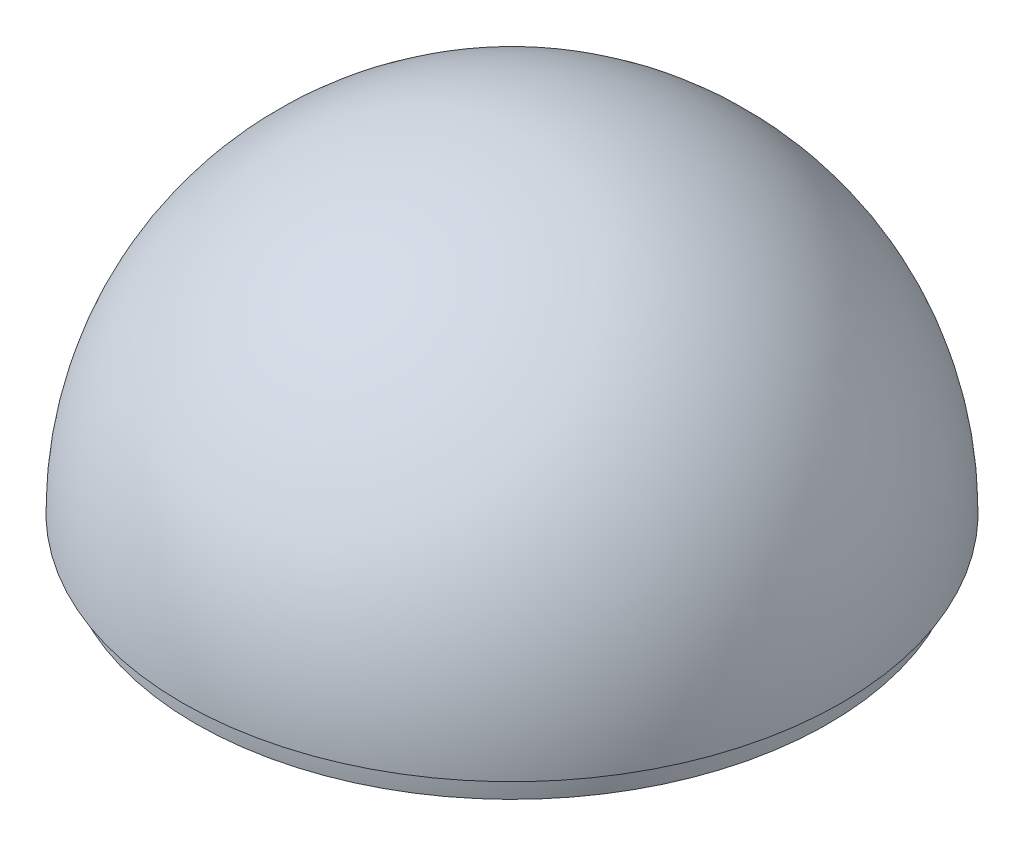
ISO-10303-21;
HEADER;
FILE_DESCRIPTION(('STEP AP214'),'2;1');
FILE_NAME('part.step','',(''),(''),'','','');
FILE_SCHEMA(('AUTOMOTIVE_DESIGN { 1 0 10303 214 1 1 1 1 }'));
ENDSEC;
DATA;
#1=APPLICATION_CONTEXT('core data for automotive mechanical design processes');
#2=APPLICATION_PROTOCOL_DEFINITION('international standard','automotive_design',2000,#1);
#3=PRODUCT_CONTEXT('',#1,'mechanical');
#4=PRODUCT('Part','Part','',(#3));
#5=PRODUCT_RELATED_PRODUCT_CATEGORY('part','',(#4));
#6=PRODUCT_DEFINITION_FORMATION('','',#4);
#7=PRODUCT_DEFINITION_CONTEXT('part definition',#1,'design');
#8=PRODUCT_DEFINITION('design','',#6,#7);
#9=PRODUCT_DEFINITION_SHAPE('','',#8);
#10=(LENGTH_UNIT() NAMED_UNIT(*) SI_UNIT(.MILLI.,.METRE.));
#11=(NAMED_UNIT(*) PLANE_ANGLE_UNIT() SI_UNIT($,.RADIAN.));
#12=(NAMED_UNIT(*) SI_UNIT($,.STERADIAN.) SOLID_ANGLE_UNIT());
#13=UNCERTAINTY_MEASURE_WITH_UNIT(LENGTH_MEASURE(1.E-05),#10,'distance_accuracy_value','');
#14=(GEOMETRIC_REPRESENTATION_CONTEXT(3) GLOBAL_UNCERTAINTY_ASSIGNED_CONTEXT((#13)) GLOBAL_UNIT_ASSIGNED_CONTEXT((#10,
#11,#12)) REPRESENTATION_CONTEXT('',''));
#15=CARTESIAN_POINT('',(0.,0.,0.));
#16=DIRECTION('',(0.,0.,1.));
#17=DIRECTION('',(1.,0.,0.));
#18=AXIS2_PLACEMENT_3D('',#15,#16,#17);
#19=CARTESIAN_POINT('',(40.,102.003499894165,0.));
#20=DIRECTION('',(0.,-1.,0.));
#21=DIRECTION('',(0.,0.,-1.));
#22=AXIS2_PLACEMENT_3D('',#19,#20,#21);
#23=PLANE('',#22);
#24=CARTESIAN_POINT('',(0.,102.003499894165,0.));
#25=DIRECTION('',(0.,1.,0.));
#26=DIRECTION('',(0.,0.,1.));
#27=AXIS2_PLACEMENT_3D('',#24,#25,#26);
#28=CIRCLE('',#27,40.);
#29=CARTESIAN_POINT('',(0.,102.003499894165,40.));
#30=VERTEX_POINT('',#29);
#31=EDGE_CURVE('E39',#30,#30,#28,.T.);
#32=ORIENTED_EDGE('',*,*,#31,.F.);
#33=EDGE_LOOP('',(#32));
#34=FACE_BOUND('',#33,.T.);
#35=CARTESIAN_POINT('',(0.,102.003499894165,0.));
#36=DIRECTION('',(0.,1.,0.));
#37=DIRECTION('',(0.,0.,1.));
#38=AXIS2_PLACEMENT_3D('',#35,#36,#37);
#39=CIRCLE('',#38,38.5);
#40=CARTESIAN_POINT('',(0.,102.003499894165,38.5));
#41=VERTEX_POINT('',#40);
#42=EDGE_CURVE('E43',#41,#41,#39,.T.);
#43=ORIENTED_EDGE('',*,*,#42,.T.);
#44=EDGE_LOOP('',(#43));
#45=FACE_BOUND('',#44,.T.);
#46=ADVANCED_FACE('F32',(#34,#45),#23,.T.);
#47=CARTESIAN_POINT('',(0.,102.003499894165,0.));
#48=DIRECTION('',(0.,1.,0.));
#49=DIRECTION('',(1.,0.,0.));
#50=AXIS2_PLACEMENT_3D('',#47,#48,#49);
#51=SPHERICAL_SURFACE('',#50,40.);
#52=ORIENTED_EDGE('',*,*,#31,.T.);
#53=EDGE_LOOP('',(#52));
#54=FACE_BOUND('',#53,.T.);
#55=ADVANCED_FACE('F34',(#54),#51,.T.);
#56=CARTESIAN_POINT('',(0.,102.003499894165,0.));
#57=DIRECTION('',(0.,1.,0.));
#58=DIRECTION('',(1.,0.,0.));
#59=AXIS2_PLACEMENT_3D('',#56,#57,#58);
#60=SPHERICAL_SURFACE('',#59,38.5);
#61=ORIENTED_EDGE('',*,*,#42,.F.);
#62=EDGE_LOOP('',(#61));
#63=FACE_BOUND('',#62,.T.);
#64=CARTESIAN_POINT('',(0.,99.0034998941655,0.));
#65=DIRECTION('',(0.,1.,0.));
#66=DIRECTION('',(0.,0.,1.));
#67=AXIS2_PLACEMENT_3D('',#64,#65,#66);
#68=CIRCLE('',#67,38.3829389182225);
#69=CARTESIAN_POINT('',(0.,99.0034998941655,38.3829389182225));
#70=VERTEX_POINT('',#69);
#71=EDGE_CURVE('E52',#70,#70,#68,.T.);
#72=ORIENTED_EDGE('',*,*,#71,.T.);
#73=EDGE_LOOP('',(#72));
#74=FACE_BOUND('',#73,.T.);
#75=ADVANCED_FACE('F56',(#63,#74),#60,.T.);
#76=CARTESIAN_POINT('',(0.,111.941040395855,0.));
#77=DIRECTION('',(0.,1.,0.));
#78=DIRECTION('',(0.,0.,1.));
#79=AXIS2_PLACEMENT_3D('',#76,#77,#78);
#80=CYLINDRICAL_SURFACE('',#79,37.);
#81=CARTESIAN_POINT('',(0.,99.0034998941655,0.));
#82=DIRECTION('',(0.,1.,0.));
#83=DIRECTION('',(0.,0.,1.));
#84=AXIS2_PLACEMENT_3D('',#81,#82,#83);
#85=CIRCLE('',#84,37.);
#86=CARTESIAN_POINT('',(0.,99.0034998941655,37.));
#87=VERTEX_POINT('',#86);
#88=EDGE_CURVE('E47',#87,#87,#85,.T.);
#89=ORIENTED_EDGE('',*,*,#88,.F.);
#90=EDGE_LOOP('',(#89));
#91=FACE_BOUND('',#90,.T.);
#92=CARTESIAN_POINT('',(0.,102.003499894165,0.));
#93=DIRECTION('',(0.,1.,0.));
#94=DIRECTION('',(0.,0.,1.));
#95=AXIS2_PLACEMENT_3D('',#92,#93,#94);
#96=CIRCLE('',#95,37.);
#97=CARTESIAN_POINT('',(0.,102.003499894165,37.));
#98=VERTEX_POINT('',#97);
#99=EDGE_CURVE('E10',#98,#98,#96,.T.);
#100=ORIENTED_EDGE('',*,*,#99,.T.);
#101=EDGE_LOOP('',(#100));
#102=FACE_BOUND('',#101,.T.);
#103=ADVANCED_FACE('F62',(#91,#102),#80,.F.);
#104=CARTESIAN_POINT('',(37.,99.0034998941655,0.));
#105=DIRECTION('',(0.,1.,0.));
#106=DIRECTION('',(0.,0.,1.));
#107=AXIS2_PLACEMENT_3D('',#104,#105,#106);
#108=PLANE('',#107);
#109=ORIENTED_EDGE('',*,*,#71,.F.);
#110=EDGE_LOOP('',(#109));
#111=FACE_BOUND('',#110,.T.);
#112=ORIENTED_EDGE('',*,*,#88,.T.);
#113=EDGE_LOOP('',(#112));
#114=FACE_BOUND('',#113,.T.);
#115=ADVANCED_FACE('F58',(#111,#114),#108,.F.);
#116=CARTESIAN_POINT('',(0.,102.003499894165,0.));
#117=DIRECTION('',(0.,1.,0.));
#118=DIRECTION('',(1.,0.,0.));
#119=AXIS2_PLACEMENT_3D('',#116,#117,#118);
#120=SPHERICAL_SURFACE('',#119,37.);
#121=ORIENTED_EDGE('',*,*,#99,.F.);
#122=EDGE_LOOP('',(#121));
#123=FACE_BOUND('',#122,.T.);
#124=ADVANCED_FACE('F61',(#123),#120,.F.);
#125=CLOSED_SHELL('',(#46,#55,#75,#103,#115,#124));
#126=MANIFOLD_SOLID_BREP('B2',#125);
#127=ADVANCED_BREP_SHAPE_REPRESENTATION('',(#18,#126),#14);
#128=SHAPE_DEFINITION_REPRESENTATION(#9,#127);
ENDSEC;
END-ISO-10303-21;
